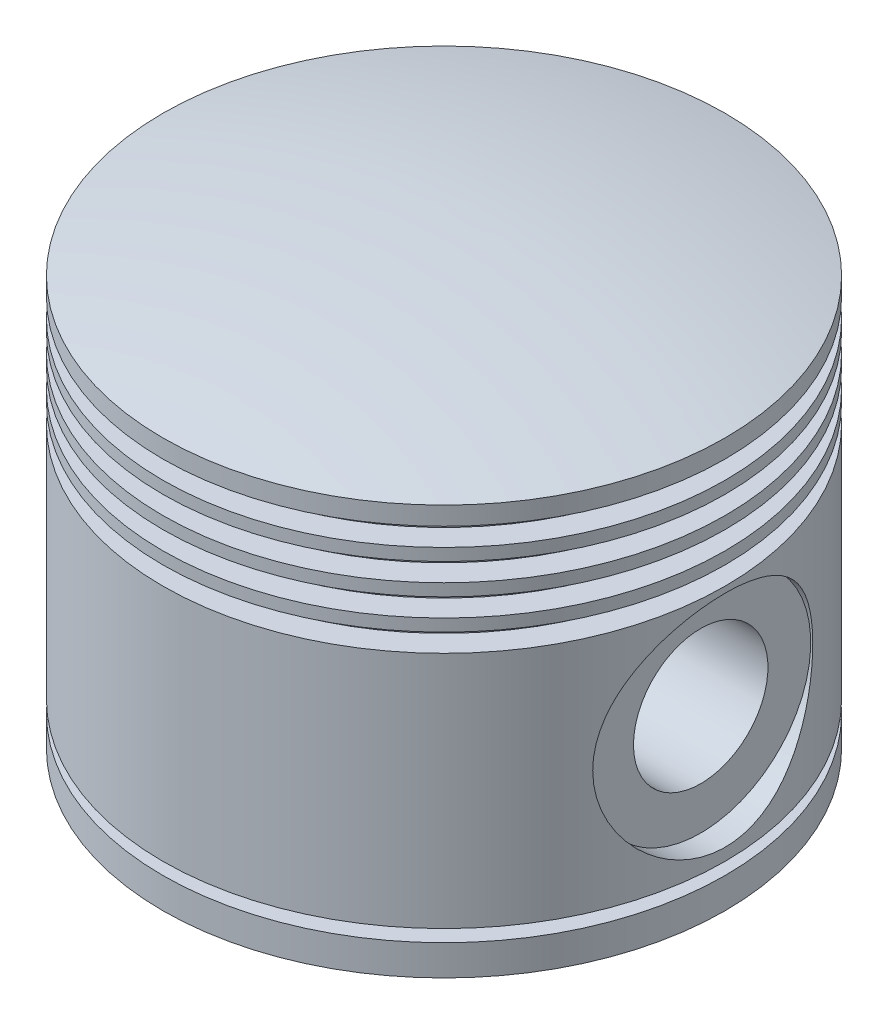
from build123d import *

# Parameters (mm, degrees)
BOSS_EXTRUDE1_REACH = 113.534
SKETCH3_R           = 19.25


with BuildPart() as part:
    # Sketch1 → Revolve1 (revolve)
    with BuildSketch(Plane.XY, mode=Mode.PRIVATE) as revolve1_sk:
        with BuildLine():
            Line((37, 62), (37, 42))
            Line((37, 42), (38.5, 42))
            Line((38.5, 42), (38.5, 12))
            Line((38.5, 12), (37, 12))
            Line((37, 12), (37, 0))
            Line((37, 0), (46, 0))
            Line((46, 0), (46, 5))
            Line((46, 5), (42, 5))
            Line((42, 5), (42, 7))
            Line((42, 7), (46, 7))
            Line((46, 7), (46, 46))
            Line((46, 46), (42, 46))
            Line((42, 46), (42, 49))
            Line((42, 49), (46, 49))
            Line((46, 49), (46, 51))
            Line((46, 51), (42, 51))
            Line((42, 51), (42, 54))
            Line((42, 54), (46, 54))
            Line((46, 54), (46, 56))
            Line((46, 56), (42, 56))
            Line((42, 56), (42, 59))
            Line((42, 59), (46, 59))
            Line((46, 59), (46, 61))
            Line((46, 61), (42, 61))
            Line((42, 61), (42, 64))
            Line((42, 64), (46, 64))
            Line((46, 64), (46, 67))
            ThreePointArc((46, 67), (23.174880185, 71.257119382), (0, 72.683334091))
            Line((0, 72.683334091), (0, 62))
            Line((0, 62), (37, 62))
        make_face()
    revolve(revolve1_sk.sketch.rotate(Axis((0, 39.592018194, 0), (0, -1, 0)), 90), axis=Axis((0, 39.592018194, 0), (0, -1, 0)))

    # Sketch3 → Boss-Extrude1 (add, up to next)
    with BuildSketch(Plane(origin=(25, 0, 0), x_dir=(0, 0, -1), z_dir=(1, 0, 0)), mode=Mode.PRIVATE) as boss_extrude1_sk1:
        with Locations(Location((0, 27, 0), (0, 0, 128.810714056))):
            Circle(SKETCH3_R)
    boss_extrude1_tool1 = extrude(boss_extrude1_sk1.sketch, amount=BOSS_EXTRUDE1_REACH, mode=Mode.PRIVATE) - part.part
    boss_extrude1 = boss_extrude1_tool1.solids().sort_by_distance((25, 27, 0))[0]
    add(boss_extrude1)

    # Sketch5 → Cut-Revolve1 (revolve, cut)
    with BuildSketch(Plane.XY, mode=Mode.PRIVATE) as cut_revolve1_sk:
        Polygon((25, 27), (46, 27), (46, 45), (42, 45), (42, 38), (25, 38), align=None)
    cut_revolve1 = revolve(cut_revolve1_sk.sketch.rotate(Axis((-14.724424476, 27, 0), (1, 0, 0)), 90), axis=Axis((-14.724424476, 27, 0), (1, 0, 0)), mode=Mode.SUBTRACT)

    # Mirror1: Boss-Extrude1, Cut-Revolve1 across plane
    add(boss_extrude1.mirror(Plane(origin=(0, 0, 0), x_dir=(0, 0, 1), z_dir=(1, 0, 0))))
    add(cut_revolve1.mirror(Plane(origin=(0, 0, 0), x_dir=(0, 0, 1), z_dir=(1, 0, 0))), mode=Mode.SUBTRACT)


solid = part.part
